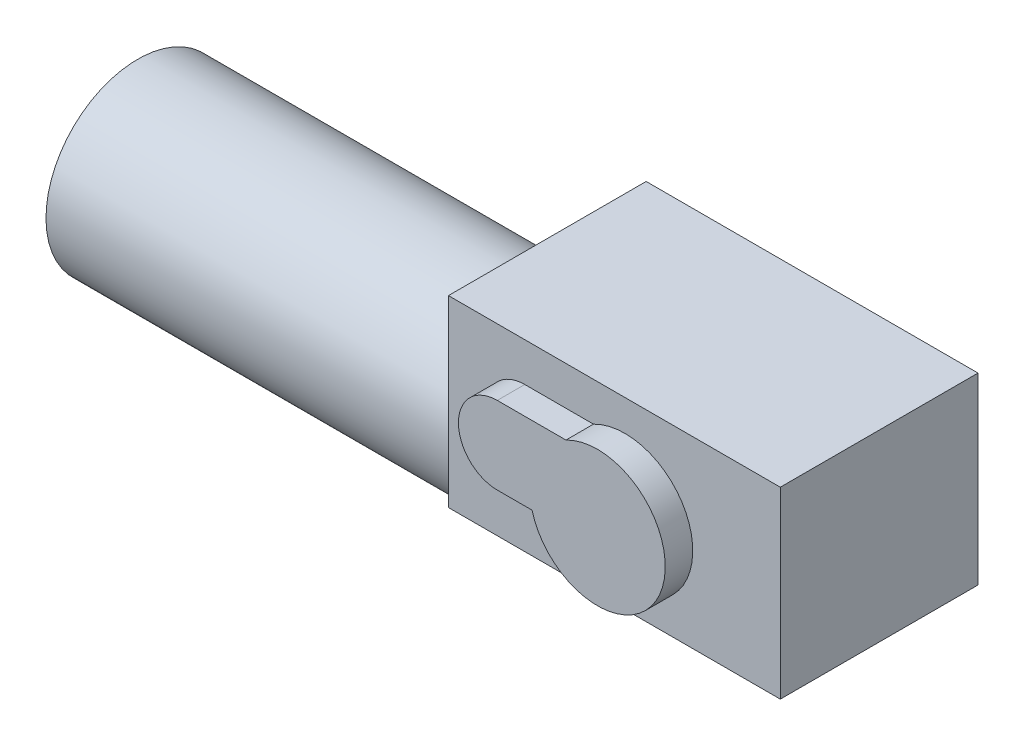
ISO-10303-21;
HEADER;
FILE_DESCRIPTION(('STEP AP214'),'2;1');
FILE_NAME('part.step','',(''),(''),'','','');
FILE_SCHEMA(('AUTOMOTIVE_DESIGN { 1 0 10303 214 1 1 1 1 }'));
ENDSEC;
DATA;
#1=APPLICATION_CONTEXT('core data for automotive mechanical design processes');
#2=APPLICATION_PROTOCOL_DEFINITION('international standard','automotive_design',2000,#1);
#3=PRODUCT_CONTEXT('',#1,'mechanical');
#4=PRODUCT('Part','Part','',(#3));
#5=PRODUCT_RELATED_PRODUCT_CATEGORY('part','',(#4));
#6=PRODUCT_DEFINITION_FORMATION('','',#4);
#7=PRODUCT_DEFINITION_CONTEXT('part definition',#1,'design');
#8=PRODUCT_DEFINITION('design','',#6,#7);
#9=PRODUCT_DEFINITION_SHAPE('','',#8);
#10=(LENGTH_UNIT() NAMED_UNIT(*) SI_UNIT(.MILLI.,.METRE.));
#11=(NAMED_UNIT(*) PLANE_ANGLE_UNIT() SI_UNIT($,.RADIAN.));
#12=(NAMED_UNIT(*) SI_UNIT($,.STERADIAN.) SOLID_ANGLE_UNIT());
#13=UNCERTAINTY_MEASURE_WITH_UNIT(LENGTH_MEASURE(1.E-05),#10,'distance_accuracy_value','');
#14=(GEOMETRIC_REPRESENTATION_CONTEXT(3) GLOBAL_UNCERTAINTY_ASSIGNED_CONTEXT((#13)) GLOBAL_UNIT_ASSIGNED_CONTEXT((#10,
#11,#12)) REPRESENTATION_CONTEXT('',''));
#15=CARTESIAN_POINT('',(0.,0.,0.));
#16=DIRECTION('',(0.,0.,1.));
#17=DIRECTION('',(1.,0.,0.));
#18=AXIS2_PLACEMENT_3D('',#15,#16,#17);
#19=CARTESIAN_POINT('',(184.15,0.,0.));
#20=DIRECTION('',(-1.,0.,0.));
#21=DIRECTION('',(0.,0.,1.));
#22=AXIS2_PLACEMENT_3D('',#19,#20,#21);
#23=CYLINDRICAL_SURFACE('',#22,41.275);
#24=CARTESIAN_POINT('',(184.15,0.,0.));
#25=DIRECTION('',(1.,0.,0.));
#26=DIRECTION('',(0.,0.,-1.));
#27=AXIS2_PLACEMENT_3D('',#24,#25,#26);
#28=CIRCLE('',#27,41.275);
#29=CARTESIAN_POINT('',(184.15,-19.05,36.6158862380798));
#30=VERTEX_POINT('',#29);
#31=CARTESIAN_POINT('',(184.15,-19.05,-36.6158862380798));
#32=VERTEX_POINT('',#31);
#33=EDGE_CURVE('E216',#30,#32,#28,.T.);
#34=ORIENTED_EDGE('',*,*,#33,.F.);
#35=EDGE_CURVE('E218',#32,#30,#28,.T.);
#36=ORIENTED_EDGE('',*,*,#35,.F.);
#37=EDGE_LOOP('',(#34,#36));
#38=FACE_BOUND('',#37,.T.);
#39=CARTESIAN_POINT('',(0.,0.,0.));
#40=DIRECTION('',(1.,0.,0.));
#41=DIRECTION('',(0.,0.,-1.));
#42=AXIS2_PLACEMENT_3D('',#39,#40,#41);
#43=CIRCLE('',#42,41.275);
#44=CARTESIAN_POINT('',(0.,0.,-41.275));
#45=VERTEX_POINT('',#44);
#46=EDGE_CURVE('E215',#45,#45,#43,.T.);
#47=ORIENTED_EDGE('',*,*,#46,.T.);
#48=EDGE_LOOP('',(#47));
#49=FACE_BOUND('',#48,.T.);
#50=ADVANCED_FACE('F31',(#38,#49),#23,.T.);
#51=CARTESIAN_POINT('',(184.15,0.,0.));
#52=DIRECTION('',(1.,0.,0.));
#53=DIRECTION('',(0.,0.,-1.));
#54=AXIS2_PLACEMENT_3D('',#51,#52,#53);
#55=PLANE('',#54);
#56=DIRECTION('',(0.,0.,-1.));
#57=VECTOR('',#56,1.);
#58=CARTESIAN_POINT('',(184.15,-19.05,0.));
#59=LINE('',#58,#57);
#60=EDGE_CURVE('E203',#30,#32,#59,.T.);
#61=ORIENTED_EDGE('',*,*,#60,.F.);
#62=ORIENTED_EDGE('',*,*,#33,.T.);
#63=EDGE_LOOP('',(#61,#62));
#64=FACE_BOUND('',#63,.T.);
#65=ADVANCED_FACE('F248',(#64),#55,.T.);
#66=CARTESIAN_POINT('',(0.,0.,0.));
#67=DIRECTION('',(1.,0.,0.));
#68=DIRECTION('',(0.,0.,-1.));
#69=AXIS2_PLACEMENT_3D('',#66,#67,#68);
#70=PLANE('',#69);
#71=ORIENTED_EDGE('',*,*,#46,.F.);
#72=EDGE_LOOP('',(#71));
#73=FACE_BOUND('',#72,.T.);
#74=ADVANCED_FACE('F253',(#73),#70,.F.);
#75=CARTESIAN_POINT('',(184.15,-19.05,-44.45));
#76=DIRECTION('',(1.,0.,0.));
#77=DIRECTION('',(0.,0.,-1.));
#78=AXIS2_PLACEMENT_3D('',#75,#76,#77);
#79=PLANE('',#78);
#80=CARTESIAN_POINT('',(184.15,-19.05,-44.45));
#81=VERTEX_POINT('',#80);
#82=EDGE_CURVE('E200',#32,#81,#59,.T.);
#83=ORIENTED_EDGE('',*,*,#82,.F.);
#84=ORIENTED_EDGE('',*,*,#35,.T.);
#85=CARTESIAN_POINT('',(184.15,-19.05,44.45));
#86=VERTEX_POINT('',#85);
#87=EDGE_CURVE('E187',#86,#30,#59,.T.);
#88=ORIENTED_EDGE('',*,*,#87,.F.);
#89=DIRECTION('',(0.,-1.,0.));
#90=VECTOR('',#89,1.);
#91=CARTESIAN_POINT('',(184.15,63.5,44.45));
#92=LINE('',#91,#90);
#93=CARTESIAN_POINT('',(184.15,63.5,44.45));
#94=VERTEX_POINT('',#93);
#95=EDGE_CURVE('E198',#94,#86,#92,.T.);
#96=ORIENTED_EDGE('',*,*,#95,.F.);
#97=DIRECTION('',(0.,0.,1.));
#98=VECTOR('',#97,1.);
#99=CARTESIAN_POINT('',(184.15,63.5,-44.45));
#100=LINE('',#99,#98);
#101=CARTESIAN_POINT('',(184.15,63.5,-44.45));
#102=VERTEX_POINT('',#101);
#103=EDGE_CURVE('E196',#102,#94,#100,.T.);
#104=ORIENTED_EDGE('',*,*,#103,.F.);
#105=DIRECTION('',(0.,1.,0.));
#106=VECTOR('',#105,1.);
#107=CARTESIAN_POINT('',(184.15,-19.05,-44.45));
#108=LINE('',#107,#106);
#109=EDGE_CURVE('E182',#81,#102,#108,.T.);
#110=ORIENTED_EDGE('',*,*,#109,.F.);
#111=EDGE_LOOP('',(#83,#84,#88,#96,#104,#110));
#112=FACE_BOUND('',#111,.T.);
#113=ADVANCED_FACE('F263',(#112),#79,.F.);
#114=CARTESIAN_POINT('',(333.375,-19.05,-44.45));
#115=DIRECTION('',(0.,0.,1.));
#116=DIRECTION('',(1.,0.,0.));
#117=AXIS2_PLACEMENT_3D('',#114,#115,#116);
#118=PLANE('',#117);
#119=DIRECTION('',(-1.,0.,0.));
#120=VECTOR('',#119,1.);
#121=CARTESIAN_POINT('',(333.375,46.0381142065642,-44.45));
#122=LINE('',#121,#120);
#123=CARTESIAN_POINT('',(249.359122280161,46.0381142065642,-44.45));
#124=VERTEX_POINT('',#123);
#125=CARTESIAN_POINT('',(218.4781,46.0381142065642,-44.45));
#126=VERTEX_POINT('',#125);
#127=EDGE_CURVE('E176',#124,#126,#122,.T.);
#128=ORIENTED_EDGE('',*,*,#127,.T.);
#129=CARTESIAN_POINT('',(218.4781,28.575,-44.45));
#130=DIRECTION('',(0.,0.,1.));
#131=DIRECTION('',(1.,0.,0.));
#132=AXIS2_PLACEMENT_3D('',#129,#130,#131);
#133=CIRCLE('',#132,17.4631142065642);
#134=CARTESIAN_POINT('',(218.4781,11.1118857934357,-44.45));
#135=VERTEX_POINT('',#134);
#136=EDGE_CURVE('E179',#126,#135,#133,.T.);
#137=ORIENTED_EDGE('',*,*,#136,.T.);
#138=DIRECTION('',(1.,0.,0.));
#139=VECTOR('',#138,1.);
#140=CARTESIAN_POINT('',(333.375,11.1118857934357,-44.45));
#141=LINE('',#140,#139);
#142=CARTESIAN_POINT('',(234.096837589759,11.1118857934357,-44.45));
#143=VERTEX_POINT('',#142);
#144=EDGE_CURVE('E163',#135,#143,#141,.T.);
#145=ORIENTED_EDGE('',*,*,#144,.T.);
#146=CARTESIAN_POINT('',(263.525,19.05,-44.45));
#147=DIRECTION('',(0.,0.,1.));
#148=DIRECTION('',(1.,0.,0.));
#149=AXIS2_PLACEMENT_3D('',#146,#147,#148);
#150=CIRCLE('',#149,30.48);
#151=EDGE_CURVE('E173',#143,#124,#150,.T.);
#152=ORIENTED_EDGE('',*,*,#151,.T.);
#153=EDGE_LOOP('',(#128,#137,#145,#152));
#154=FACE_BOUND('',#153,.T.);
#155=ORIENTED_EDGE('',*,*,#109,.T.);
#156=DIRECTION('',(-1.,0.,0.));
#157=VECTOR('',#156,1.);
#158=CARTESIAN_POINT('',(333.375,63.5,-44.45));
#159=LINE('',#158,#157);
#160=CARTESIAN_POINT('',(333.375,63.5,-44.45));
#161=VERTEX_POINT('',#160);
#162=EDGE_CURVE('E209',#161,#102,#159,.T.);
#163=ORIENTED_EDGE('',*,*,#162,.F.);
#164=DIRECTION('',(0.,1.,0.));
#165=VECTOR('',#164,1.);
#166=CARTESIAN_POINT('',(333.375,-19.05,-44.45));
#167=LINE('',#166,#165);
#168=CARTESIAN_POINT('',(333.375,-19.05,-44.45));
#169=VERTEX_POINT('',#168);
#170=EDGE_CURVE('E186',#169,#161,#167,.T.);
#171=ORIENTED_EDGE('',*,*,#170,.F.);
#172=DIRECTION('',(-1.,0.,0.));
#173=VECTOR('',#172,1.);
#174=CARTESIAN_POINT('',(333.375,-19.05,-44.45));
#175=LINE('',#174,#173);
#176=EDGE_CURVE('E212',#169,#81,#175,.T.);
#177=ORIENTED_EDGE('',*,*,#176,.T.);
#178=EDGE_LOOP('',(#155,#163,#171,#177));
#179=FACE_BOUND('',#178,.T.);
#180=ADVANCED_FACE('F267',(#154,#179),#118,.F.);
#181=CARTESIAN_POINT('',(333.375,63.5,-44.45));
#182=DIRECTION('',(0.,-1.,0.));
#183=DIRECTION('',(0.,0.,-1.));
#184=AXIS2_PLACEMENT_3D('',#181,#182,#183);
#185=PLANE('',#184);
#186=ORIENTED_EDGE('',*,*,#103,.T.);
#187=DIRECTION('',(-1.,0.,0.));
#188=VECTOR('',#187,1.);
#189=CARTESIAN_POINT('',(333.375,63.5,44.45));
#190=LINE('',#189,#188);
#191=CARTESIAN_POINT('',(333.375,63.5,44.45));
#192=VERTEX_POINT('',#191);
#193=EDGE_CURVE('E206',#192,#94,#190,.T.);
#194=ORIENTED_EDGE('',*,*,#193,.F.);
#195=DIRECTION('',(0.,0.,1.));
#196=VECTOR('',#195,1.);
#197=CARTESIAN_POINT('',(333.375,63.5,-44.45));
#198=LINE('',#197,#196);
#199=EDGE_CURVE('E189',#161,#192,#198,.T.);
#200=ORIENTED_EDGE('',*,*,#199,.F.);
#201=ORIENTED_EDGE('',*,*,#162,.T.);
#202=EDGE_LOOP('',(#186,#194,#200,#201));
#203=FACE_BOUND('',#202,.T.);
#204=ADVANCED_FACE('F273',(#203),#185,.F.);
#205=CARTESIAN_POINT('',(333.375,63.5,44.45));
#206=DIRECTION('',(0.,0.,-1.));
#207=DIRECTION('',(-1.,0.,0.));
#208=AXIS2_PLACEMENT_3D('',#205,#206,#207);
#209=PLANE('',#208);
#210=DIRECTION('',(-1.,0.,0.));
#211=VECTOR('',#210,1.);
#212=CARTESIAN_POINT('',(333.375,11.1118857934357,44.45));
#213=LINE('',#212,#211);
#214=CARTESIAN_POINT('',(234.096837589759,11.1118857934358,44.45));
#215=VERTEX_POINT('',#214);
#216=CARTESIAN_POINT('',(218.4781,11.1118857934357,44.45));
#217=VERTEX_POINT('',#216);
#218=EDGE_CURVE('E221',#215,#217,#213,.T.);
#219=ORIENTED_EDGE('',*,*,#218,.T.);
#220=CARTESIAN_POINT('',(218.4781,28.575,44.45));
#221=DIRECTION('',(0.,0.,-1.));
#222=DIRECTION('',(-1.,0.,0.));
#223=AXIS2_PLACEMENT_3D('',#220,#221,#222);
#224=CIRCLE('',#223,17.4631142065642);
#225=CARTESIAN_POINT('',(218.4781,46.0381142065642,44.45));
#226=VERTEX_POINT('',#225);
#227=EDGE_CURVE('E11',#217,#226,#224,.T.);
#228=ORIENTED_EDGE('',*,*,#227,.T.);
#229=DIRECTION('',(1.,0.,0.));
#230=VECTOR('',#229,1.);
#231=CARTESIAN_POINT('',(333.375,46.0381142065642,44.45));
#232=LINE('',#231,#230);
#233=CARTESIAN_POINT('',(249.359122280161,46.0381142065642,44.45));
#234=VERTEX_POINT('',#233);
#235=EDGE_CURVE('E38',#226,#234,#232,.T.);
#236=ORIENTED_EDGE('',*,*,#235,.T.);
#237=CARTESIAN_POINT('',(263.525,19.05,44.45));
#238=DIRECTION('',(0.,0.,-1.));
#239=DIRECTION('',(-1.,0.,0.));
#240=AXIS2_PLACEMENT_3D('',#237,#238,#239);
#241=CIRCLE('',#240,30.48);
#242=EDGE_CURVE('E223',#234,#215,#241,.T.);
#243=ORIENTED_EDGE('',*,*,#242,.T.);
#244=EDGE_LOOP('',(#219,#228,#236,#243));
#245=FACE_BOUND('',#244,.T.);
#246=ORIENTED_EDGE('',*,*,#95,.T.);
#247=DIRECTION('',(-1.,0.,0.));
#248=VECTOR('',#247,1.);
#249=CARTESIAN_POINT('',(333.375,-19.05,44.45));
#250=LINE('',#249,#248);
#251=CARTESIAN_POINT('',(333.375,-19.05,44.45));
#252=VERTEX_POINT('',#251);
#253=EDGE_CURVE('E194',#252,#86,#250,.T.);
#254=ORIENTED_EDGE('',*,*,#253,.F.);
#255=DIRECTION('',(0.,-1.,0.));
#256=VECTOR('',#255,1.);
#257=CARTESIAN_POINT('',(333.375,63.5,44.45));
#258=LINE('',#257,#256);
#259=EDGE_CURVE('E191',#192,#252,#258,.T.);
#260=ORIENTED_EDGE('',*,*,#259,.F.);
#261=ORIENTED_EDGE('',*,*,#193,.T.);
#262=EDGE_LOOP('',(#246,#254,#260,#261));
#263=FACE_BOUND('',#262,.T.);
#264=ADVANCED_FACE('F227',(#245,#263),#209,.F.);
#265=CARTESIAN_POINT('',(333.375,-19.05,0.));
#266=DIRECTION('',(0.,1.,0.));
#267=DIRECTION('',(0.,0.,1.));
#268=AXIS2_PLACEMENT_3D('',#265,#266,#267);
#269=PLANE('',#268);
#270=ORIENTED_EDGE('',*,*,#87,.T.);
#271=ORIENTED_EDGE('',*,*,#60,.T.);
#272=ORIENTED_EDGE('',*,*,#82,.T.);
#273=ORIENTED_EDGE('',*,*,#176,.F.);
#274=DIRECTION('',(0.,0.,-1.));
#275=VECTOR('',#274,1.);
#276=CARTESIAN_POINT('',(333.375,-19.05,0.));
#277=LINE('',#276,#275);
#278=EDGE_CURVE('E183',#252,#169,#277,.T.);
#279=ORIENTED_EDGE('',*,*,#278,.F.);
#280=ORIENTED_EDGE('',*,*,#253,.T.);
#281=EDGE_LOOP('',(#270,#271,#272,#273,#279,#280));
#282=FACE_BOUND('',#281,.T.);
#283=ADVANCED_FACE('F280',(#282),#269,.F.);
#284=CARTESIAN_POINT('',(333.375,-19.05,-44.45));
#285=DIRECTION('',(1.,0.,0.));
#286=DIRECTION('',(0.,0.,-1.));
#287=AXIS2_PLACEMENT_3D('',#284,#285,#286);
#288=PLANE('',#287);
#289=ORIENTED_EDGE('',*,*,#278,.T.);
#290=ORIENTED_EDGE('',*,*,#170,.T.);
#291=ORIENTED_EDGE('',*,*,#199,.T.);
#292=ORIENTED_EDGE('',*,*,#259,.T.);
#293=EDGE_LOOP('',(#289,#290,#291,#292));
#294=FACE_BOUND('',#293,.T.);
#295=ADVANCED_FACE('F282',(#294),#288,.T.);
#296=CARTESIAN_POINT('',(218.4781,28.575,56.8198));
#297=DIRECTION('',(0.,0.,1.));
#298=DIRECTION('',(1.,0.,0.));
#299=AXIS2_PLACEMENT_3D('',#296,#297,#298);
#300=PLANE('',#299);
#301=CARTESIAN_POINT('',(218.4781,28.575,56.8198));
#302=DIRECTION('',(0.,0.,1.));
#303=DIRECTION('',(1.,0.,0.));
#304=AXIS2_PLACEMENT_3D('',#301,#302,#303);
#305=CIRCLE('',#304,17.4631142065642);
#306=CARTESIAN_POINT('',(218.4781,46.0381142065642,56.8198));
#307=VERTEX_POINT('',#306);
#308=CARTESIAN_POINT('',(218.4781,11.1118857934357,56.8198));
#309=VERTEX_POINT('',#308);
#310=EDGE_CURVE('E127',#307,#309,#305,.T.);
#311=ORIENTED_EDGE('',*,*,#310,.T.);
#312=DIRECTION('',(1.,0.,0.));
#313=VECTOR('',#312,1.);
#314=CARTESIAN_POINT('',(218.4781,11.1118857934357,56.8198));
#315=LINE('',#314,#313);
#316=CARTESIAN_POINT('',(234.096837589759,11.1118857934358,56.8198));
#317=VERTEX_POINT('',#316);
#318=EDGE_CURVE('E133',#309,#317,#315,.T.);
#319=ORIENTED_EDGE('',*,*,#318,.T.);
#320=CARTESIAN_POINT('',(263.525,19.05,56.8198));
#321=DIRECTION('',(0.,0.,1.));
#322=DIRECTION('',(1.,0.,0.));
#323=AXIS2_PLACEMENT_3D('',#320,#321,#322);
#324=CIRCLE('',#323,30.48);
#325=CARTESIAN_POINT('',(249.359122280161,46.0381142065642,56.8198));
#326=VERTEX_POINT('',#325);
#327=EDGE_CURVE('E140',#317,#326,#324,.T.);
#328=ORIENTED_EDGE('',*,*,#327,.T.);
#329=DIRECTION('',(-1.,0.,0.));
#330=VECTOR('',#329,1.);
#331=CARTESIAN_POINT('',(218.4781,46.0381142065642,56.8198));
#332=LINE('',#331,#330);
#333=EDGE_CURVE('E145',#326,#307,#332,.T.);
#334=ORIENTED_EDGE('',*,*,#333,.T.);
#335=EDGE_LOOP('',(#311,#319,#328,#334));
#336=FACE_BOUND('',#335,.T.);
#337=ADVANCED_FACE('F143',(#336),#300,.T.);
#338=CARTESIAN_POINT('',(218.4781,11.1118857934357,-56.8198));
#339=DIRECTION('',(0.,-1.,0.));
#340=DIRECTION('',(0.,0.,-1.));
#341=AXIS2_PLACEMENT_3D('',#338,#339,#340);
#342=PLANE('',#341);
#343=ORIENTED_EDGE('',*,*,#218,.F.);
#344=DIRECTION('',(0.,0.,1.));
#345=VECTOR('',#344,1.);
#346=CARTESIAN_POINT('',(234.096837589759,11.1118857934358,-56.8198));
#347=LINE('',#346,#345);
#348=EDGE_CURVE('E136',#215,#317,#347,.T.);
#349=ORIENTED_EDGE('',*,*,#348,.T.);
#350=ORIENTED_EDGE('',*,*,#318,.F.);
#351=DIRECTION('',(0.,0.,1.));
#352=VECTOR('',#351,1.);
#353=CARTESIAN_POINT('',(218.4781,11.1118857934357,-56.8198));
#354=LINE('',#353,#352);
#355=EDGE_CURVE('E53',#217,#309,#354,.T.);
#356=ORIENTED_EDGE('',*,*,#355,.F.);
#357=EDGE_LOOP('',(#343,#349,#350,#356));
#358=FACE_BOUND('',#357,.T.);
#359=ADVANCED_FACE('F134',(#358),#342,.T.);
#360=CARTESIAN_POINT('',(263.525,19.05,-56.8198));
#361=DIRECTION('',(0.,0.,1.));
#362=DIRECTION('',(1.,0.,0.));
#363=AXIS2_PLACEMENT_3D('',#360,#361,#362);
#364=CYLINDRICAL_SURFACE('',#363,30.48);
#365=ORIENTED_EDGE('',*,*,#242,.F.);
#366=DIRECTION('',(0.,0.,1.));
#367=VECTOR('',#366,1.);
#368=CARTESIAN_POINT('',(249.359122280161,46.0381142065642,-56.8198));
#369=LINE('',#368,#367);
#370=EDGE_CURVE('E168',#234,#326,#369,.T.);
#371=ORIENTED_EDGE('',*,*,#370,.T.);
#372=ORIENTED_EDGE('',*,*,#327,.F.);
#373=ORIENTED_EDGE('',*,*,#348,.F.);
#374=EDGE_LOOP('',(#365,#371,#372,#373));
#375=FACE_BOUND('',#374,.T.);
#376=ADVANCED_FACE('F233',(#375),#364,.T.);
#377=CARTESIAN_POINT('',(218.4781,46.0381142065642,-56.8198));
#378=DIRECTION('',(0.,1.,0.));
#379=DIRECTION('',(0.,0.,1.));
#380=AXIS2_PLACEMENT_3D('',#377,#378,#379);
#381=PLANE('',#380);
#382=ORIENTED_EDGE('',*,*,#235,.F.);
#383=DIRECTION('',(0.,0.,1.));
#384=VECTOR('',#383,1.);
#385=CARTESIAN_POINT('',(218.4781,46.0381142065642,-56.8198));
#386=LINE('',#385,#384);
#387=EDGE_CURVE('E164',#226,#307,#386,.T.);
#388=ORIENTED_EDGE('',*,*,#387,.T.);
#389=ORIENTED_EDGE('',*,*,#333,.F.);
#390=ORIENTED_EDGE('',*,*,#370,.F.);
#391=EDGE_LOOP('',(#382,#388,#389,#390));
#392=FACE_BOUND('',#391,.T.);
#393=ADVANCED_FACE('F231',(#392),#381,.T.);
#394=CARTESIAN_POINT('',(218.4781,28.575,-56.8198));
#395=DIRECTION('',(0.,0.,1.));
#396=DIRECTION('',(1.,0.,0.));
#397=AXIS2_PLACEMENT_3D('',#394,#395,#396);
#398=CYLINDRICAL_SURFACE('',#397,17.4631142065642);
#399=ORIENTED_EDGE('',*,*,#227,.F.);
#400=ORIENTED_EDGE('',*,*,#355,.T.);
#401=ORIENTED_EDGE('',*,*,#310,.F.);
#402=ORIENTED_EDGE('',*,*,#387,.F.);
#403=EDGE_LOOP('',(#399,#400,#401,#402));
#404=FACE_BOUND('',#403,.T.);
#405=ADVANCED_FACE('F124',(#404),#398,.T.);
#406=ORIENTED_EDGE('',*,*,#136,.F.);
#407=CARTESIAN_POINT('',(218.4781,46.0381142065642,-56.8198));
#408=VERTEX_POINT('',#407);
#409=EDGE_CURVE('E160',#408,#126,#386,.T.);
#410=ORIENTED_EDGE('',*,*,#409,.F.);
#411=CARTESIAN_POINT('',(218.4781,28.575,-56.8198));
#412=DIRECTION('',(0.,0.,1.));
#413=DIRECTION('',(1.,0.,0.));
#414=AXIS2_PLACEMENT_3D('',#411,#412,#413);
#415=CIRCLE('',#414,17.4631142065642);
#416=CARTESIAN_POINT('',(218.4781,11.1118857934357,-56.8198));
#417=VERTEX_POINT('',#416);
#418=EDGE_CURVE('E150',#408,#417,#415,.T.);
#419=ORIENTED_EDGE('',*,*,#418,.T.);
#420=EDGE_CURVE('E129',#417,#135,#354,.T.);
#421=ORIENTED_EDGE('',*,*,#420,.T.);
#422=EDGE_LOOP('',(#406,#410,#419,#421));
#423=FACE_BOUND('',#422,.T.);
#424=ADVANCED_FACE('F288',(#423),#398,.T.);
#425=ORIENTED_EDGE('',*,*,#127,.F.);
#426=CARTESIAN_POINT('',(249.359122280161,46.0381142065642,-56.8198));
#427=VERTEX_POINT('',#426);
#428=EDGE_CURVE('E165',#427,#124,#369,.T.);
#429=ORIENTED_EDGE('',*,*,#428,.F.);
#430=DIRECTION('',(-1.,0.,0.));
#431=VECTOR('',#430,1.);
#432=CARTESIAN_POINT('',(218.4781,46.0381142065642,-56.8198));
#433=LINE('',#432,#431);
#434=EDGE_CURVE('E130',#427,#408,#433,.T.);
#435=ORIENTED_EDGE('',*,*,#434,.T.);
#436=ORIENTED_EDGE('',*,*,#409,.T.);
#437=EDGE_LOOP('',(#425,#429,#435,#436));
#438=FACE_BOUND('',#437,.T.);
#439=ADVANCED_FACE('F242',(#438),#381,.T.);
#440=ORIENTED_EDGE('',*,*,#151,.F.);
#441=CARTESIAN_POINT('',(234.096837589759,11.1118857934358,-56.8198));
#442=VERTEX_POINT('',#441);
#443=EDGE_CURVE('E45',#442,#143,#347,.T.);
#444=ORIENTED_EDGE('',*,*,#443,.F.);
#445=CARTESIAN_POINT('',(263.525,19.05,-56.8198));
#446=DIRECTION('',(0.,0.,1.));
#447=DIRECTION('',(1.,0.,0.));
#448=AXIS2_PLACEMENT_3D('',#445,#446,#447);
#449=CIRCLE('',#448,30.48);
#450=EDGE_CURVE('E155',#442,#427,#449,.T.);
#451=ORIENTED_EDGE('',*,*,#450,.T.);
#452=ORIENTED_EDGE('',*,*,#428,.T.);
#453=EDGE_LOOP('',(#440,#444,#451,#452));
#454=FACE_BOUND('',#453,.T.);
#455=ADVANCED_FACE('F236',(#454),#364,.T.);
#456=ORIENTED_EDGE('',*,*,#144,.F.);
#457=ORIENTED_EDGE('',*,*,#420,.F.);
#458=DIRECTION('',(1.,0.,0.));
#459=VECTOR('',#458,1.);
#460=CARTESIAN_POINT('',(218.4781,11.1118857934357,-56.8198));
#461=LINE('',#460,#459);
#462=EDGE_CURVE('E153',#417,#442,#461,.T.);
#463=ORIENTED_EDGE('',*,*,#462,.T.);
#464=ORIENTED_EDGE('',*,*,#443,.T.);
#465=EDGE_LOOP('',(#456,#457,#463,#464));
#466=FACE_BOUND('',#465,.T.);
#467=ADVANCED_FACE('F244',(#466),#342,.T.);
#468=CARTESIAN_POINT('',(218.4781,28.575,-56.8198));
#469=DIRECTION('',(0.,0.,1.));
#470=DIRECTION('',(1.,0.,0.));
#471=AXIS2_PLACEMENT_3D('',#468,#469,#470);
#472=PLANE('',#471);
#473=ORIENTED_EDGE('',*,*,#418,.F.);
#474=ORIENTED_EDGE('',*,*,#434,.F.);
#475=ORIENTED_EDGE('',*,*,#450,.F.);
#476=ORIENTED_EDGE('',*,*,#462,.F.);
#477=EDGE_LOOP('',(#473,#474,#475,#476));
#478=FACE_BOUND('',#477,.T.);
#479=ADVANCED_FACE('F292',(#478),#472,.F.);
#480=CLOSED_SHELL('',(#50,#65,#74,#113,#180,#204,#264,#283,#295,#337,#359,#376,#393,#405,#424,
#439,#455,#467,#479));
#481=MANIFOLD_SOLID_BREP('B2',#480);
#482=ADVANCED_BREP_SHAPE_REPRESENTATION('',(#18,#481),#14);
#483=SHAPE_DEFINITION_REPRESENTATION(#9,#482);
ENDSEC;
END-ISO-10303-21;
